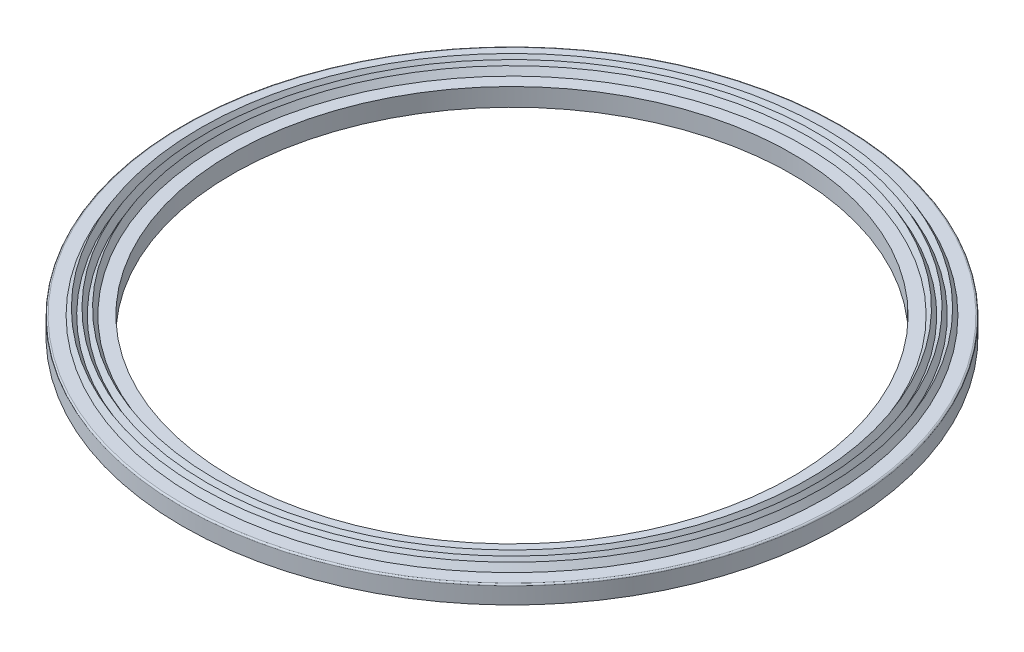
ISO-10303-21;
HEADER;
FILE_DESCRIPTION(('STEP AP214'),'2;1');
FILE_NAME('part.step','',(''),(''),'','','');
FILE_SCHEMA(('AUTOMOTIVE_DESIGN { 1 0 10303 214 1 1 1 1 }'));
ENDSEC;
DATA;
#1=APPLICATION_CONTEXT('core data for automotive mechanical design processes');
#2=APPLICATION_PROTOCOL_DEFINITION('international standard','automotive_design',2000,#1);
#3=PRODUCT_CONTEXT('',#1,'mechanical');
#4=PRODUCT('Part','Part','',(#3));
#5=PRODUCT_RELATED_PRODUCT_CATEGORY('part','',(#4));
#6=PRODUCT_DEFINITION_FORMATION('','',#4);
#7=PRODUCT_DEFINITION_CONTEXT('part definition',#1,'design');
#8=PRODUCT_DEFINITION('design','',#6,#7);
#9=PRODUCT_DEFINITION_SHAPE('','',#8);
#10=(LENGTH_UNIT() NAMED_UNIT(*) SI_UNIT(.MILLI.,.METRE.));
#11=(NAMED_UNIT(*) PLANE_ANGLE_UNIT() SI_UNIT($,.RADIAN.));
#12=(NAMED_UNIT(*) SI_UNIT($,.STERADIAN.) SOLID_ANGLE_UNIT());
#13=UNCERTAINTY_MEASURE_WITH_UNIT(LENGTH_MEASURE(1.E-05),#10,'distance_accuracy_value','');
#14=(GEOMETRIC_REPRESENTATION_CONTEXT(3) GLOBAL_UNCERTAINTY_ASSIGNED_CONTEXT((#13)) GLOBAL_UNIT_ASSIGNED_CONTEXT((#10,
#11,#12)) REPRESENTATION_CONTEXT('',''));
#15=CARTESIAN_POINT('',(0.,0.,0.));
#16=DIRECTION('',(0.,0.,1.));
#17=DIRECTION('',(1.,0.,0.));
#18=AXIS2_PLACEMENT_3D('',#15,#16,#17);
#19=CARTESIAN_POINT('',(0.,87.6487556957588,0.));
#20=DIRECTION('',(0.,1.,0.));
#21=DIRECTION('',(0.,0.,1.));
#22=AXIS2_PLACEMENT_3D('',#19,#20,#21);
#23=CYLINDRICAL_SURFACE('',#22,93.5);
#24=CARTESIAN_POINT('',(0.,55.9824801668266,0.));
#25=DIRECTION('',(0.,1.,0.));
#26=DIRECTION('',(0.,0.,1.));
#27=AXIS2_PLACEMENT_3D('',#24,#25,#26);
#28=CIRCLE('',#27,93.5);
#29=CARTESIAN_POINT('',(0.,55.9824801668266,93.5000000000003));
#30=VERTEX_POINT('',#29);
#31=EDGE_CURVE('E84',#30,#30,#28,.T.);
#32=ORIENTED_EDGE('',*,*,#31,.T.);
#33=EDGE_LOOP('',(#32));
#34=FACE_BOUND('',#33,.T.);
#35=CARTESIAN_POINT('',(0.,49.9824801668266,0.));
#36=DIRECTION('',(0.,1.,0.));
#37=DIRECTION('',(0.,0.,1.));
#38=AXIS2_PLACEMENT_3D('',#35,#36,#37);
#39=CIRCLE('',#38,93.5);
#40=CARTESIAN_POINT('',(0.,49.9824801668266,93.5000000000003));
#41=VERTEX_POINT('',#40);
#42=EDGE_CURVE('E10',#41,#41,#39,.T.);
#43=ORIENTED_EDGE('',*,*,#42,.F.);
#44=EDGE_LOOP('',(#43));
#45=FACE_BOUND('',#44,.T.);
#46=ADVANCED_FACE('F32',(#34,#45),#23,.F.);
#47=CARTESIAN_POINT('',(-95.5000000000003,49.9824801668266,0.));
#48=DIRECTION('',(0.,-1.,0.));
#49=DIRECTION('',(0.,0.,-1.));
#50=AXIS2_PLACEMENT_3D('',#47,#48,#49);
#51=PLANE('',#50);
#52=ORIENTED_EDGE('',*,*,#42,.T.);
#53=EDGE_LOOP('',(#52));
#54=FACE_BOUND('',#53,.T.);
#55=CARTESIAN_POINT('',(0.,49.9824801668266,0.));
#56=DIRECTION('',(0.,1.,0.));
#57=DIRECTION('',(0.,0.,1.));
#58=AXIS2_PLACEMENT_3D('',#55,#56,#57);
#59=CIRCLE('',#58,95.5);
#60=CARTESIAN_POINT('',(0.,49.9824801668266,95.5000000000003));
#61=VERTEX_POINT('',#60);
#62=EDGE_CURVE('E38',#61,#61,#59,.T.);
#63=ORIENTED_EDGE('',*,*,#62,.F.);
#64=EDGE_LOOP('',(#63));
#65=FACE_BOUND('',#64,.T.);
#66=ADVANCED_FACE('F102',(#54,#65),#51,.T.);
#67=CARTESIAN_POINT('',(0.,87.6487556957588,0.));
#68=DIRECTION('',(0.,1.,0.));
#69=DIRECTION('',(0.,0.,1.));
#70=AXIS2_PLACEMENT_3D('',#67,#68,#69);
#71=CYLINDRICAL_SURFACE('',#70,95.5);
#72=ORIENTED_EDGE('',*,*,#62,.T.);
#73=EDGE_LOOP('',(#72));
#74=FACE_BOUND('',#73,.T.);
#75=CARTESIAN_POINT('',(0.,53.9824801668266,0.));
#76=DIRECTION('',(0.,1.,0.));
#77=DIRECTION('',(0.,0.,1.));
#78=AXIS2_PLACEMENT_3D('',#75,#76,#77);
#79=CIRCLE('',#78,95.5);
#80=CARTESIAN_POINT('',(0.,53.9824801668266,95.5000000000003));
#81=VERTEX_POINT('',#80);
#82=EDGE_CURVE('E42',#81,#81,#79,.T.);
#83=ORIENTED_EDGE('',*,*,#82,.F.);
#84=EDGE_LOOP('',(#83));
#85=FACE_BOUND('',#84,.T.);
#86=ADVANCED_FACE('F106',(#74,#85),#71,.T.);
#87=CARTESIAN_POINT('',(-109.,53.9824801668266,0.));
#88=DIRECTION('',(0.,-1.,0.));
#89=DIRECTION('',(0.,0.,-1.));
#90=AXIS2_PLACEMENT_3D('',#87,#88,#89);
#91=PLANE('',#90);
#92=ORIENTED_EDGE('',*,*,#82,.T.);
#93=EDGE_LOOP('',(#92));
#94=FACE_BOUND('',#93,.T.);
#95=CARTESIAN_POINT('',(0.,53.9824801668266,0.));
#96=DIRECTION('',(0.,1.,0.));
#97=DIRECTION('',(0.,0.,1.));
#98=AXIS2_PLACEMENT_3D('',#95,#96,#97);
#99=CIRCLE('',#98,109.);
#100=CARTESIAN_POINT('',(0.,53.9824801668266,109.));
#101=VERTEX_POINT('',#100);
#102=EDGE_CURVE('E46',#101,#101,#99,.T.);
#103=ORIENTED_EDGE('',*,*,#102,.F.);
#104=EDGE_LOOP('',(#103));
#105=FACE_BOUND('',#104,.T.);
#106=ADVANCED_FACE('F110',(#94,#105),#91,.T.);
#107=CARTESIAN_POINT('',(0.,87.6487556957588,0.));
#108=DIRECTION('',(0.,1.,0.));
#109=DIRECTION('',(0.,0.,1.));
#110=AXIS2_PLACEMENT_3D('',#107,#108,#109);
#111=CYLINDRICAL_SURFACE('',#110,109.);
#112=ORIENTED_EDGE('',*,*,#102,.T.);
#113=EDGE_LOOP('',(#112));
#114=FACE_BOUND('',#113,.T.);
#115=CARTESIAN_POINT('',(0.,49.9824801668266,0.));
#116=DIRECTION('',(0.,1.,0.));
#117=DIRECTION('',(0.,0.,1.));
#118=AXIS2_PLACEMENT_3D('',#115,#116,#117);
#119=CIRCLE('',#118,109.);
#120=CARTESIAN_POINT('',(0.,49.9824801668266,109.));
#121=VERTEX_POINT('',#120);
#122=EDGE_CURVE('E51',#121,#121,#119,.T.);
#123=ORIENTED_EDGE('',*,*,#122,.F.);
#124=EDGE_LOOP('',(#123));
#125=FACE_BOUND('',#124,.T.);
#126=ADVANCED_FACE('F116',(#114,#125),#111,.F.);
#127=CARTESIAN_POINT('',(-110.,49.9824801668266,0.));
#128=DIRECTION('',(0.,-1.,0.));
#129=DIRECTION('',(0.,0.,-1.));
#130=AXIS2_PLACEMENT_3D('',#127,#128,#129);
#131=PLANE('',#130);
#132=ORIENTED_EDGE('',*,*,#122,.T.);
#133=EDGE_LOOP('',(#132));
#134=FACE_BOUND('',#133,.T.);
#135=CARTESIAN_POINT('',(0.,49.9824801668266,0.));
#136=DIRECTION('',(0.,1.,0.));
#137=DIRECTION('',(0.,0.,1.));
#138=AXIS2_PLACEMENT_3D('',#135,#136,#137);
#139=CIRCLE('',#138,110.);
#140=CARTESIAN_POINT('',(0.,49.9824801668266,110.));
#141=VERTEX_POINT('',#140);
#142=EDGE_CURVE('E54',#141,#141,#139,.T.);
#143=ORIENTED_EDGE('',*,*,#142,.F.);
#144=EDGE_LOOP('',(#143));
#145=FACE_BOUND('',#144,.T.);
#146=ADVANCED_FACE('F120',(#134,#145),#131,.T.);
#147=CARTESIAN_POINT('',(0.,87.6487556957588,0.));
#148=DIRECTION('',(0.,1.,0.));
#149=DIRECTION('',(0.,0.,1.));
#150=AXIS2_PLACEMENT_3D('',#147,#148,#149);
#151=CYLINDRICAL_SURFACE('',#150,110.);
#152=ORIENTED_EDGE('',*,*,#142,.T.);
#153=EDGE_LOOP('',(#152));
#154=FACE_BOUND('',#153,.T.);
#155=CARTESIAN_POINT('',(0.,55.4824801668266,0.));
#156=DIRECTION('',(0.,1.,0.));
#157=DIRECTION('',(0.,0.,1.));
#158=AXIS2_PLACEMENT_3D('',#155,#156,#157);
#159=CIRCLE('',#158,110.);
#160=CARTESIAN_POINT('',(0.,55.4824801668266,110.));
#161=VERTEX_POINT('',#160);
#162=EDGE_CURVE('E57',#161,#161,#159,.T.);
#163=ORIENTED_EDGE('',*,*,#162,.F.);
#164=EDGE_LOOP('',(#163));
#165=FACE_BOUND('',#164,.T.);
#166=ADVANCED_FACE('F124',(#154,#165),#151,.T.);
#167=CARTESIAN_POINT('',(0.,55.4824801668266,0.));
#168=DIRECTION('',(0.,1.,0.));
#169=DIRECTION('',(0.,0.,1.));
#170=AXIS2_PLACEMENT_3D('',#167,#168,#169);
#171=TOROIDAL_SURFACE('',#170,109.5,0.500000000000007);
#172=ORIENTED_EDGE('',*,*,#162,.T.);
#173=EDGE_LOOP('',(#172));
#174=FACE_BOUND('',#173,.T.);
#175=CARTESIAN_POINT('',(0.,55.9824801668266,0.));
#176=DIRECTION('',(0.,1.,0.));
#177=DIRECTION('',(0.,0.,1.));
#178=AXIS2_PLACEMENT_3D('',#175,#176,#177);
#179=CIRCLE('',#178,109.5);
#180=CARTESIAN_POINT('',(0.,55.9824801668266,109.5));
#181=VERTEX_POINT('',#180);
#182=EDGE_CURVE('E60',#181,#181,#179,.T.);
#183=ORIENTED_EDGE('',*,*,#182,.F.);
#184=EDGE_LOOP('',(#183));
#185=FACE_BOUND('',#184,.T.);
#186=ADVANCED_FACE('F128',(#174,#185),#171,.T.);
#187=CARTESIAN_POINT('',(-105.25,55.9824801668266,0.));
#188=DIRECTION('',(0.,1.,0.));
#189=DIRECTION('',(0.,0.,1.));
#190=AXIS2_PLACEMENT_3D('',#187,#188,#189);
#191=PLANE('',#190);
#192=ORIENTED_EDGE('',*,*,#182,.T.);
#193=EDGE_LOOP('',(#192));
#194=FACE_BOUND('',#193,.T.);
#195=CARTESIAN_POINT('',(0.,55.9824801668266,0.));
#196=DIRECTION('',(0.,1.,0.));
#197=DIRECTION('',(0.,0.,1.));
#198=AXIS2_PLACEMENT_3D('',#195,#196,#197);
#199=CIRCLE('',#198,105.25);
#200=CARTESIAN_POINT('',(0.,55.9824801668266,105.25));
#201=VERTEX_POINT('',#200);
#202=EDGE_CURVE('E63',#201,#201,#199,.T.);
#203=ORIENTED_EDGE('',*,*,#202,.F.);
#204=EDGE_LOOP('',(#203));
#205=FACE_BOUND('',#204,.T.);
#206=ADVANCED_FACE('F132',(#194,#205),#191,.T.);
#207=CARTESIAN_POINT('',(0.,58.1124801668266,0.));
#208=DIRECTION('',(0.,-1.,0.));
#209=DIRECTION('',(0.,0.,-1.));
#210=AXIS2_PLACEMENT_3D('',#207,#208,#209);
#211=CONICAL_SURFACE('',#210,104.,0.530697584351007);
#212=ORIENTED_EDGE('',*,*,#202,.T.);
#213=EDGE_LOOP('',(#212));
#214=FACE_BOUND('',#213,.T.);
#215=CARTESIAN_POINT('',(0.,58.1124801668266,0.));
#216=DIRECTION('',(0.,1.,0.));
#217=DIRECTION('',(0.,0.,1.));
#218=AXIS2_PLACEMENT_3D('',#215,#216,#217);
#219=CIRCLE('',#218,104.);
#220=CARTESIAN_POINT('',(0.,58.1124801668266,104.));
#221=VERTEX_POINT('',#220);
#222=EDGE_CURVE('E66',#221,#221,#219,.T.);
#223=ORIENTED_EDGE('',*,*,#222,.F.);
#224=EDGE_LOOP('',(#223));
#225=FACE_BOUND('',#224,.T.);
#226=ADVANCED_FACE('F136',(#214,#225),#211,.T.);
#227=CARTESIAN_POINT('',(0.,55.9824801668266,0.));
#228=DIRECTION('',(0.,1.,0.));
#229=DIRECTION('',(0.,0.,1.));
#230=AXIS2_PLACEMENT_3D('',#227,#228,#229);
#231=CONICAL_SURFACE('',#230,102.75,0.530697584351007);
#232=ORIENTED_EDGE('',*,*,#222,.T.);
#233=EDGE_LOOP('',(#232));
#234=FACE_BOUND('',#233,.T.);
#235=CARTESIAN_POINT('',(0.,55.9824801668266,0.));
#236=DIRECTION('',(0.,1.,0.));
#237=DIRECTION('',(0.,0.,1.));
#238=AXIS2_PLACEMENT_3D('',#235,#236,#237);
#239=CIRCLE('',#238,102.75);
#240=CARTESIAN_POINT('',(0.,55.9824801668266,102.75));
#241=VERTEX_POINT('',#240);
#242=EDGE_CURVE('E69',#241,#241,#239,.T.);
#243=ORIENTED_EDGE('',*,*,#242,.F.);
#244=EDGE_LOOP('',(#243));
#245=FACE_BOUND('',#244,.T.);
#246=ADVANCED_FACE('F140',(#234,#245),#231,.F.);
#247=CARTESIAN_POINT('',(0.,58.1124801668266,0.));
#248=DIRECTION('',(0.,-1.,0.));
#249=DIRECTION('',(0.,0.,-1.));
#250=AXIS2_PLACEMENT_3D('',#247,#248,#249);
#251=CONICAL_SURFACE('',#250,101.5,0.530697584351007);
#252=ORIENTED_EDGE('',*,*,#242,.T.);
#253=EDGE_LOOP('',(#252));
#254=FACE_BOUND('',#253,.T.);
#255=CARTESIAN_POINT('',(0.,58.1124801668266,0.));
#256=DIRECTION('',(0.,1.,0.));
#257=DIRECTION('',(0.,0.,1.));
#258=AXIS2_PLACEMENT_3D('',#255,#256,#257);
#259=CIRCLE('',#258,101.5);
#260=CARTESIAN_POINT('',(0.,58.1124801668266,101.5));
#261=VERTEX_POINT('',#260);
#262=EDGE_CURVE('E72',#261,#261,#259,.T.);
#263=ORIENTED_EDGE('',*,*,#262,.F.);
#264=EDGE_LOOP('',(#263));
#265=FACE_BOUND('',#264,.T.);
#266=ADVANCED_FACE('F144',(#254,#265),#251,.T.);
#267=CARTESIAN_POINT('',(0.,55.9824801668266,0.));
#268=DIRECTION('',(0.,1.,0.));
#269=DIRECTION('',(0.,0.,1.));
#270=AXIS2_PLACEMENT_3D('',#267,#268,#269);
#271=CONICAL_SURFACE('',#270,100.25,0.530697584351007);
#272=ORIENTED_EDGE('',*,*,#262,.T.);
#273=EDGE_LOOP('',(#272));
#274=FACE_BOUND('',#273,.T.);
#275=CARTESIAN_POINT('',(0.,55.9824801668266,0.));
#276=DIRECTION('',(0.,1.,0.));
#277=DIRECTION('',(0.,0.,1.));
#278=AXIS2_PLACEMENT_3D('',#275,#276,#277);
#279=CIRCLE('',#278,100.25);
#280=CARTESIAN_POINT('',(0.,55.9824801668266,100.25));
#281=VERTEX_POINT('',#280);
#282=EDGE_CURVE('E75',#281,#281,#279,.T.);
#283=ORIENTED_EDGE('',*,*,#282,.F.);
#284=EDGE_LOOP('',(#283));
#285=FACE_BOUND('',#284,.T.);
#286=ADVANCED_FACE('F148',(#274,#285),#271,.F.);
#287=CARTESIAN_POINT('',(0.,58.1124801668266,0.));
#288=DIRECTION('',(0.,-1.,0.));
#289=DIRECTION('',(0.,0.,-1.));
#290=AXIS2_PLACEMENT_3D('',#287,#288,#289);
#291=CONICAL_SURFACE('',#290,99.,0.530697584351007);
#292=ORIENTED_EDGE('',*,*,#282,.T.);
#293=EDGE_LOOP('',(#292));
#294=FACE_BOUND('',#293,.T.);
#295=CARTESIAN_POINT('',(0.,58.1124801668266,0.));
#296=DIRECTION('',(0.,1.,0.));
#297=DIRECTION('',(0.,0.,1.));
#298=AXIS2_PLACEMENT_3D('',#295,#296,#297);
#299=CIRCLE('',#298,99.);
#300=CARTESIAN_POINT('',(0.,58.1124801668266,99.0000000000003));
#301=VERTEX_POINT('',#300);
#302=EDGE_CURVE('E78',#301,#301,#299,.T.);
#303=ORIENTED_EDGE('',*,*,#302,.F.);
#304=EDGE_LOOP('',(#303));
#305=FACE_BOUND('',#304,.T.);
#306=ADVANCED_FACE('F98',(#294,#305),#291,.T.);
#307=CARTESIAN_POINT('',(0.,55.9824801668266,0.));
#308=DIRECTION('',(0.,1.,0.));
#309=DIRECTION('',(0.,0.,1.));
#310=AXIS2_PLACEMENT_3D('',#307,#308,#309);
#311=CONICAL_SURFACE('',#310,97.75,0.530697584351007);
#312=ORIENTED_EDGE('',*,*,#302,.T.);
#313=EDGE_LOOP('',(#312));
#314=FACE_BOUND('',#313,.T.);
#315=CARTESIAN_POINT('',(0.,55.9824801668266,0.));
#316=DIRECTION('',(0.,1.,0.));
#317=DIRECTION('',(0.,0.,1.));
#318=AXIS2_PLACEMENT_3D('',#315,#316,#317);
#319=CIRCLE('',#318,97.75);
#320=CARTESIAN_POINT('',(0.,55.9824801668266,97.7500000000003));
#321=VERTEX_POINT('',#320);
#322=EDGE_CURVE('E81',#321,#321,#319,.T.);
#323=ORIENTED_EDGE('',*,*,#322,.F.);
#324=EDGE_LOOP('',(#323));
#325=FACE_BOUND('',#324,.T.);
#326=ADVANCED_FACE('F92',(#314,#325),#311,.F.);
#327=CARTESIAN_POINT('',(-93.5000000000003,55.9824801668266,0.));
#328=DIRECTION('',(0.,1.,0.));
#329=DIRECTION('',(0.,0.,1.));
#330=AXIS2_PLACEMENT_3D('',#327,#328,#329);
#331=PLANE('',#330);
#332=ORIENTED_EDGE('',*,*,#322,.T.);
#333=EDGE_LOOP('',(#332));
#334=FACE_BOUND('',#333,.T.);
#335=ORIENTED_EDGE('',*,*,#31,.F.);
#336=EDGE_LOOP('',(#335));
#337=FACE_BOUND('',#336,.T.);
#338=ADVANCED_FACE('F90',(#334,#337),#331,.T.);
#339=CLOSED_SHELL('',(#46,#66,#86,#106,#126,#146,#166,#186,#206,#226,#246,#266,#286,#306,#326,#338));
#340=MANIFOLD_SOLID_BREP('B2',#339);
#341=ADVANCED_BREP_SHAPE_REPRESENTATION('',(#18,#340),#14);
#342=SHAPE_DEFINITION_REPRESENTATION(#9,#341);
ENDSEC;
END-ISO-10303-21;
